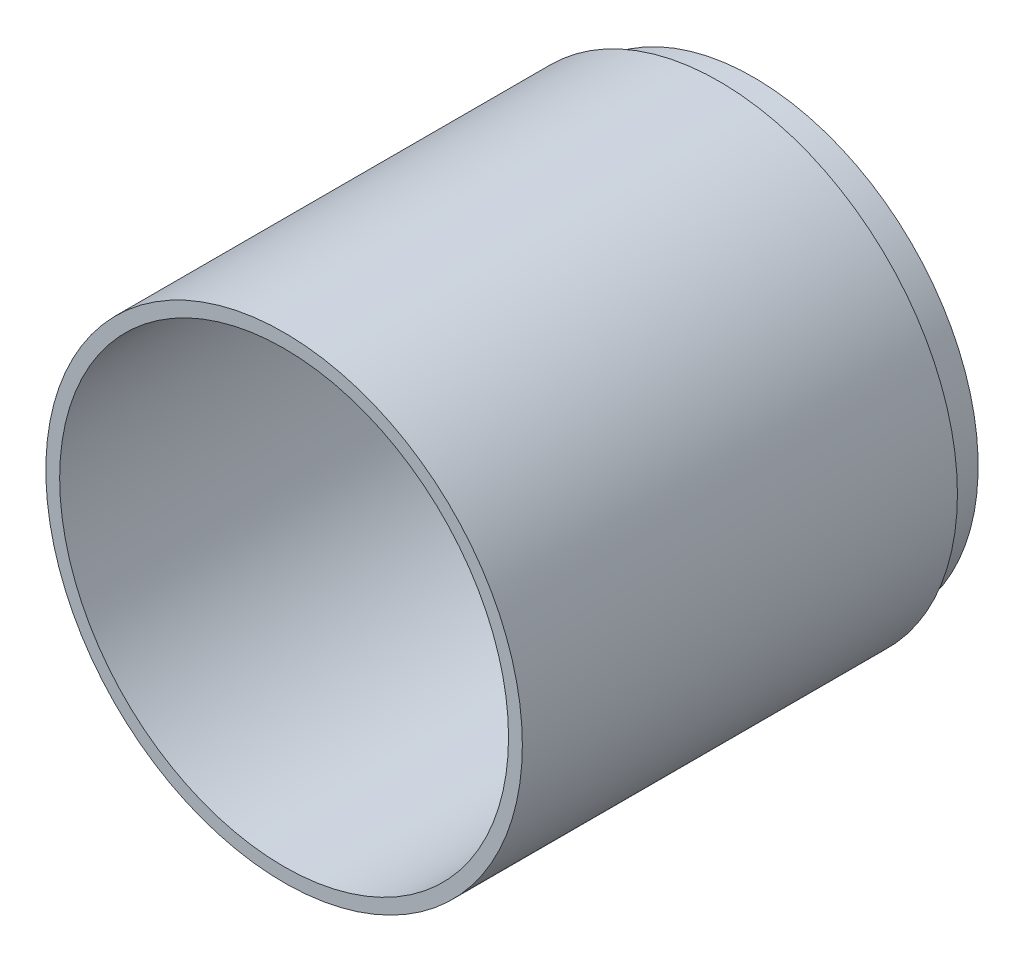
from build123d import *

# Parameters (mm, degrees)
ESQUISSE1_R             = 34.5
ESQUISSE1_R_2           = 32.5
BOSS_EXTRU_1_DEPTH      = 63
BOSS_EXTRU_2_DEPTH      = 5
BOSS_EXTRU_2_DEPTH_BACK = 3
ESQUISSE2_R             = 32.5
ESQUISSE2_R_2           = 30.5


with BuildPart() as part:
    # Esquisse1 → Boss.-Extru.1 (new body)
    with BuildSketch(Plane.XY):
        Circle(ESQUISSE1_R)
        Circle(ESQUISSE1_R_2, mode=Mode.SUBTRACT)
    extrude(amount=BOSS_EXTRU_1_DEPTH)

    # Esquisse2 → Boss.-Extru.2 (add, two sides: drawn at the far end of the back side and taken through both)
    with BuildSketch(Plane(origin=(0, 0, 0), x_dir=(-1, 0, 0), z_dir=(0, 0, -1)).offset(-BOSS_EXTRU_2_DEPTH_BACK)):
        Circle(ESQUISSE2_R)
        Circle(ESQUISSE2_R_2, mode=Mode.SUBTRACT)
    extrude(amount=BOSS_EXTRU_2_DEPTH + BOSS_EXTRU_2_DEPTH_BACK)


solid = part.part
